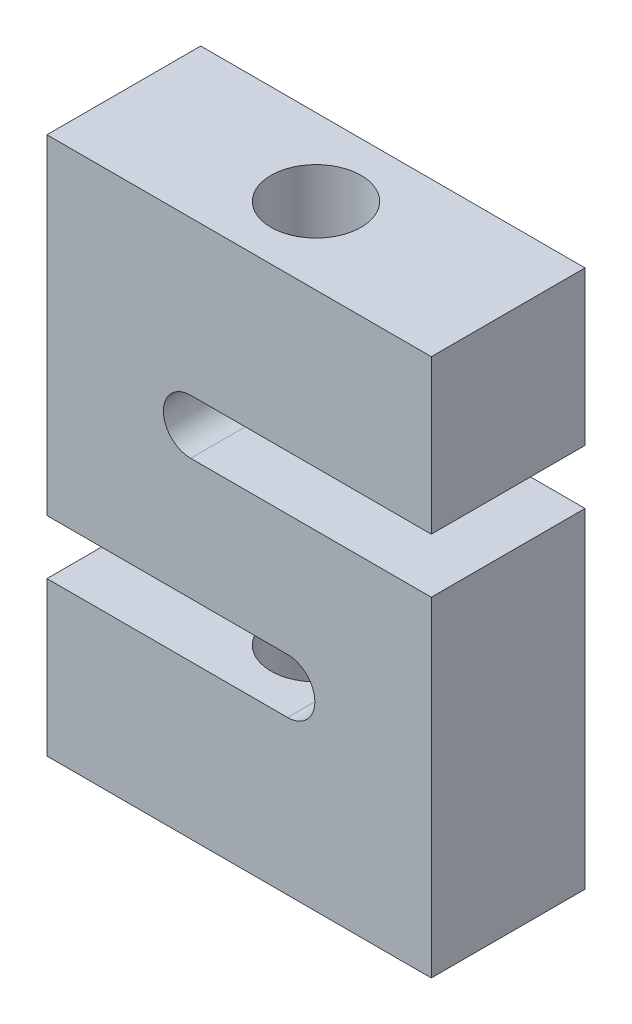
from build123d import *

# Parameters (mm, degrees)
BOSS_EXTRUDE1_DEPTH            = 25.4
F_1_1_4_12_TAPPED_HOLE1_REACH  = 192.5
F_1_1_4_12_TAPPED_HOLE1_BORE_R = 14.88313


with BuildPart() as part:
    # Sketch2 → Boss-Extrude1 (new, symmetric)
    with BuildSketch(Plane.XY):
        with BuildLine():
            Line((-63.5, 88.9), (63.5, 88.9))
            Line((63.5, 88.9), (63.5, 38.1))
            Line((63.5, 38.1), (-16.002, 38.1))
            ThreePointArc((-16.002, 38.1), (-25.019, 29.083), (-16.002, 20.066))
            Line((-16.002, 20.066), (63.5, 20.066))
            Line((63.5, 20.066), (63.5, -88.9))
            Line((63.5, -88.9), (-63.5, -88.9))
            Line((-63.5, -88.9), (-63.5, -38.1))
            Line((-63.5, -38.1), (16.002, -38.1))
            ThreePointArc((16.002, -38.1), (25.019, -29.083), (16.002, -20.066))
            Line((16.002, -20.066), (-63.5, -20.066))
            Line((-63.5, -20.066), (-63.5, 88.9))
        make_face()
    extrude(amount=BOSS_EXTRUDE1_DEPTH, both=True)

    # 1-1_4-12 Tapped Hole1 bore → 1-1_4-12 Tapped Hole1 (cut, up to next)
    with BuildSketch(Plane(origin=(0, 88.9, 0), x_dir=(1, 0, 0), z_dir=(0, 1, 0)), mode=Mode.PRIVATE) as f_1_1_4_12_tapped_hole1_sk1:
        Circle(F_1_1_4_12_TAPPED_HOLE1_BORE_R)
    f_1_1_4_12_tapped_hole1_tool1 = extrude(f_1_1_4_12_tapped_hole1_sk1.sketch, amount=-F_1_1_4_12_TAPPED_HOLE1_REACH, mode=Mode.PRIVATE) & part.part
    f_1_1_4_12_tapped_hole1 = f_1_1_4_12_tapped_hole1_tool1.solids().sort_by_distance((0, 88.9, 0))[0]
    add(f_1_1_4_12_tapped_hole1, mode=Mode.SUBTRACT)

    # Mirror1: 1-1_4-12 Tapped Hole1 across plane
    add(f_1_1_4_12_tapped_hole1.mirror(Plane.ZX), mode=Mode.SUBTRACT)


solid = part.part
